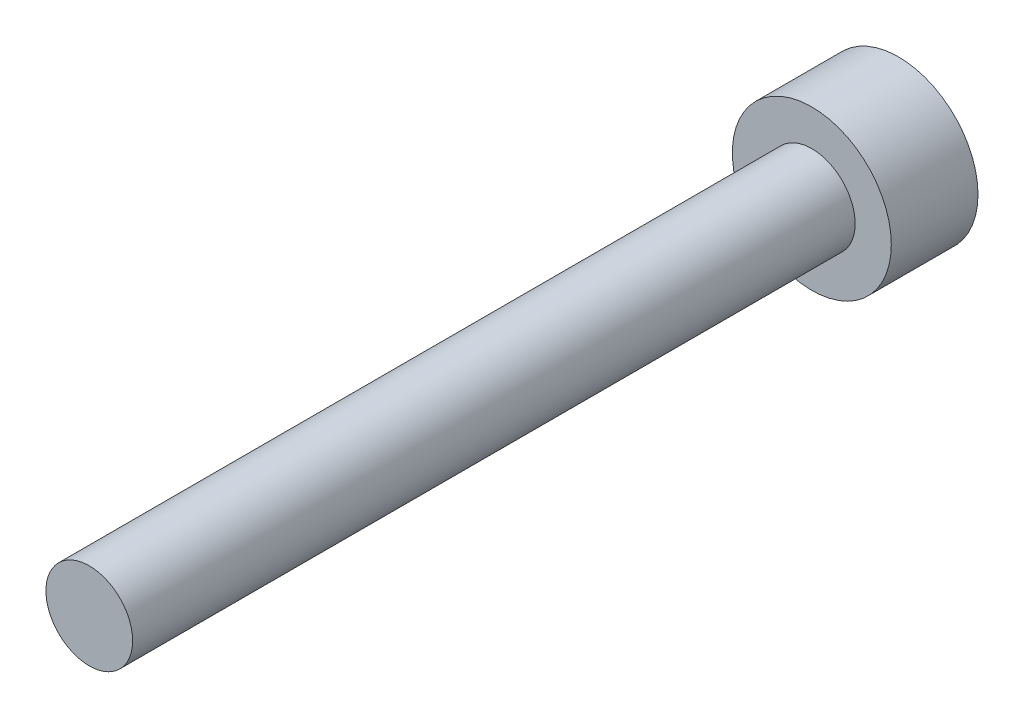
ISO-10303-21;
HEADER;
FILE_DESCRIPTION(('STEP AP214'),'2;1');
FILE_NAME('part.step','',(''),(''),'','','');
FILE_SCHEMA(('AUTOMOTIVE_DESIGN { 1 0 10303 214 1 1 1 1 }'));
ENDSEC;
DATA;
#1=APPLICATION_CONTEXT('core data for automotive mechanical design processes');
#2=APPLICATION_PROTOCOL_DEFINITION('international standard','automotive_design',2000,#1);
#3=PRODUCT_CONTEXT('',#1,'mechanical');
#4=PRODUCT('Part','Part','',(#3));
#5=PRODUCT_RELATED_PRODUCT_CATEGORY('part','',(#4));
#6=PRODUCT_DEFINITION_FORMATION('','',#4);
#7=PRODUCT_DEFINITION_CONTEXT('part definition',#1,'design');
#8=PRODUCT_DEFINITION('design','',#6,#7);
#9=PRODUCT_DEFINITION_SHAPE('','',#8);
#10=(LENGTH_UNIT() NAMED_UNIT(*) SI_UNIT(.MILLI.,.METRE.));
#11=(NAMED_UNIT(*) PLANE_ANGLE_UNIT() SI_UNIT($,.RADIAN.));
#12=(NAMED_UNIT(*) SI_UNIT($,.STERADIAN.) SOLID_ANGLE_UNIT());
#13=UNCERTAINTY_MEASURE_WITH_UNIT(LENGTH_MEASURE(1.E-05),#10,'distance_accuracy_value','');
#14=(GEOMETRIC_REPRESENTATION_CONTEXT(3) GLOBAL_UNCERTAINTY_ASSIGNED_CONTEXT((#13)) GLOBAL_UNIT_ASSIGNED_CONTEXT((#10,
#11,#12)) REPRESENTATION_CONTEXT('',''));
#15=CARTESIAN_POINT('',(0.,0.,0.));
#16=DIRECTION('',(0.,0.,1.));
#17=DIRECTION('',(1.,0.,0.));
#18=AXIS2_PLACEMENT_3D('',#15,#16,#17);
#19=CARTESIAN_POINT('',(0.,0.,0.));
#20=DIRECTION('',(0.,0.,-1.));
#21=DIRECTION('',(-1.,0.,0.));
#22=AXIS2_PLACEMENT_3D('',#19,#20,#21);
#23=CYLINDRICAL_SURFACE('',#22,2.75);
#24=CARTESIAN_POINT('',(0.,0.,0.));
#25=DIRECTION('',(0.,0.,1.));
#26=DIRECTION('',(1.,0.,0.));
#27=AXIS2_PLACEMENT_3D('',#24,#25,#26);
#28=CIRCLE('',#27,2.75);
#29=CARTESIAN_POINT('',(2.75,0.,0.));
#30=VERTEX_POINT('',#29);
#31=EDGE_CURVE('E48',#30,#30,#28,.T.);
#32=ORIENTED_EDGE('',*,*,#31,.F.);
#33=EDGE_LOOP('',(#32));
#34=FACE_BOUND('',#33,.T.);
#35=CARTESIAN_POINT('',(0.,0.,-3.));
#36=DIRECTION('',(0.,0.,1.));
#37=DIRECTION('',(1.,0.,0.));
#38=AXIS2_PLACEMENT_3D('',#35,#36,#37);
#39=CIRCLE('',#38,2.75);
#40=CARTESIAN_POINT('',(2.75,0.,-3.));
#41=VERTEX_POINT('',#40);
#42=EDGE_CURVE('E44',#41,#41,#39,.T.);
#43=ORIENTED_EDGE('',*,*,#42,.T.);
#44=EDGE_LOOP('',(#43));
#45=FACE_BOUND('',#44,.T.);
#46=ADVANCED_FACE('F41',(#34,#45),#23,.T.);
#47=CARTESIAN_POINT('',(0.,0.,0.));
#48=DIRECTION('',(0.,0.,1.));
#49=DIRECTION('',(1.,0.,0.));
#50=AXIS2_PLACEMENT_3D('',#47,#48,#49);
#51=PLANE('',#50);
#52=CARTESIAN_POINT('',(0.,0.,0.));
#53=DIRECTION('',(0.,0.,1.));
#54=DIRECTION('',(1.,0.,0.));
#55=AXIS2_PLACEMENT_3D('',#52,#53,#54);
#56=CIRCLE('',#55,1.5);
#57=CARTESIAN_POINT('',(1.5,0.,0.));
#58=VERTEX_POINT('',#57);
#59=EDGE_CURVE('E10',#58,#58,#56,.T.);
#60=ORIENTED_EDGE('',*,*,#59,.F.);
#61=EDGE_LOOP('',(#60));
#62=FACE_BOUND('',#61,.T.);
#63=ORIENTED_EDGE('',*,*,#31,.T.);
#64=EDGE_LOOP('',(#63));
#65=FACE_BOUND('',#64,.T.);
#66=ADVANCED_FACE('F65',(#62,#65),#51,.T.);
#67=CARTESIAN_POINT('',(0.,0.,-3.));
#68=DIRECTION('',(0.,0.,1.));
#69=DIRECTION('',(1.,0.,0.));
#70=AXIS2_PLACEMENT_3D('',#67,#68,#69);
#71=PLANE('',#70);
#72=ORIENTED_EDGE('',*,*,#42,.F.);
#73=EDGE_LOOP('',(#72));
#74=FACE_BOUND('',#73,.T.);
#75=ADVANCED_FACE('F62',(#74),#71,.F.);
#76=CARTESIAN_POINT('',(0.,0.,25.));
#77=DIRECTION('',(0.,0.,-1.));
#78=DIRECTION('',(-1.,0.,0.));
#79=AXIS2_PLACEMENT_3D('',#76,#77,#78);
#80=CYLINDRICAL_SURFACE('',#79,1.5);
#81=CARTESIAN_POINT('',(0.,0.,25.));
#82=DIRECTION('',(0.,0.,1.));
#83=DIRECTION('',(1.,0.,0.));
#84=AXIS2_PLACEMENT_3D('',#81,#82,#83);
#85=CIRCLE('',#84,1.5);
#86=CARTESIAN_POINT('',(1.5,0.,25.));
#87=VERTEX_POINT('',#86);
#88=EDGE_CURVE('E54',#87,#87,#85,.T.);
#89=ORIENTED_EDGE('',*,*,#88,.F.);
#90=EDGE_LOOP('',(#89));
#91=FACE_BOUND('',#90,.T.);
#92=ORIENTED_EDGE('',*,*,#59,.T.);
#93=EDGE_LOOP('',(#92));
#94=FACE_BOUND('',#93,.T.);
#95=ADVANCED_FACE('F64',(#91,#94),#80,.T.);
#96=CARTESIAN_POINT('',(0.,0.,25.));
#97=DIRECTION('',(0.,0.,1.));
#98=DIRECTION('',(1.,0.,0.));
#99=AXIS2_PLACEMENT_3D('',#96,#97,#98);
#100=PLANE('',#99);
#101=ORIENTED_EDGE('',*,*,#88,.T.);
#102=EDGE_LOOP('',(#101));
#103=FACE_BOUND('',#102,.T.);
#104=ADVANCED_FACE('F71',(#103),#100,.T.);
#105=CLOSED_SHELL('',(#46,#66,#75,#95,#104));
#106=MANIFOLD_SOLID_BREP('B2',#105);
#107=ADVANCED_BREP_SHAPE_REPRESENTATION('',(#18,#106),#14);
#108=SHAPE_DEFINITION_REPRESENTATION(#9,#107);
ENDSEC;
END-ISO-10303-21;
